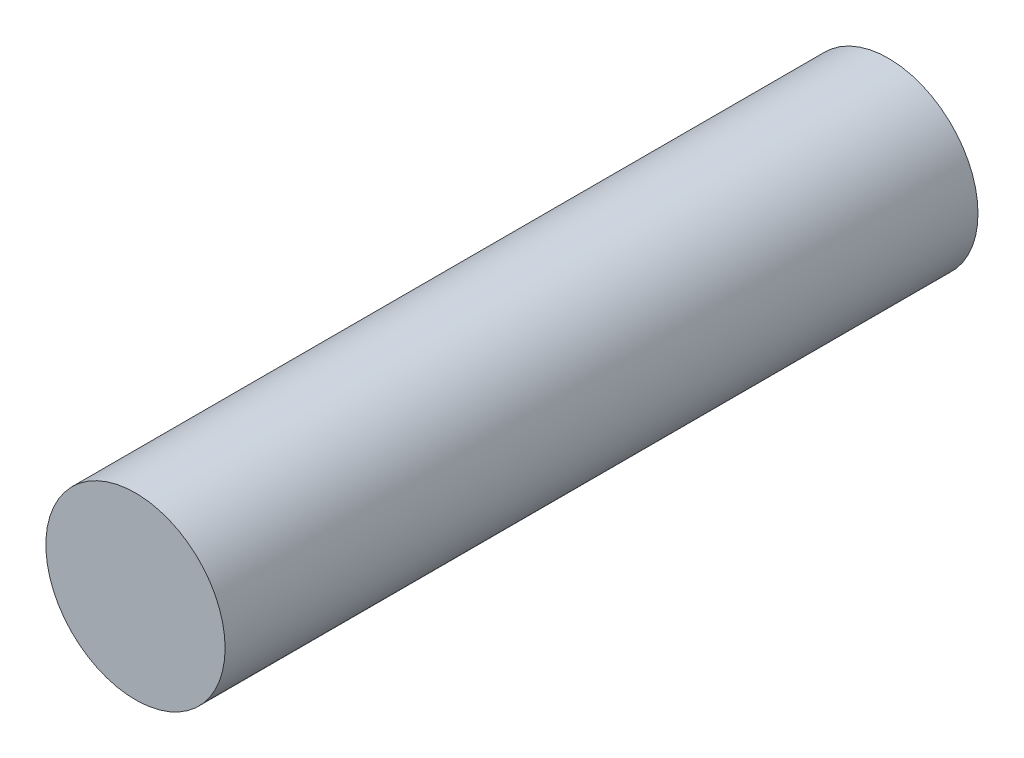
from build123d import *

# Parameters (mm, degrees)
SKETCH1_R           = 1
BOSS_EXTRUDE1_DEPTH = 4.2


with BuildPart() as part:
    # Sketch1 → Boss-Extrude1 (new, symmetric)
    with BuildSketch(Plane.XY):
        Circle(SKETCH1_R)
    extrude(amount=BOSS_EXTRUDE1_DEPTH, both=True)


solid = part.part
